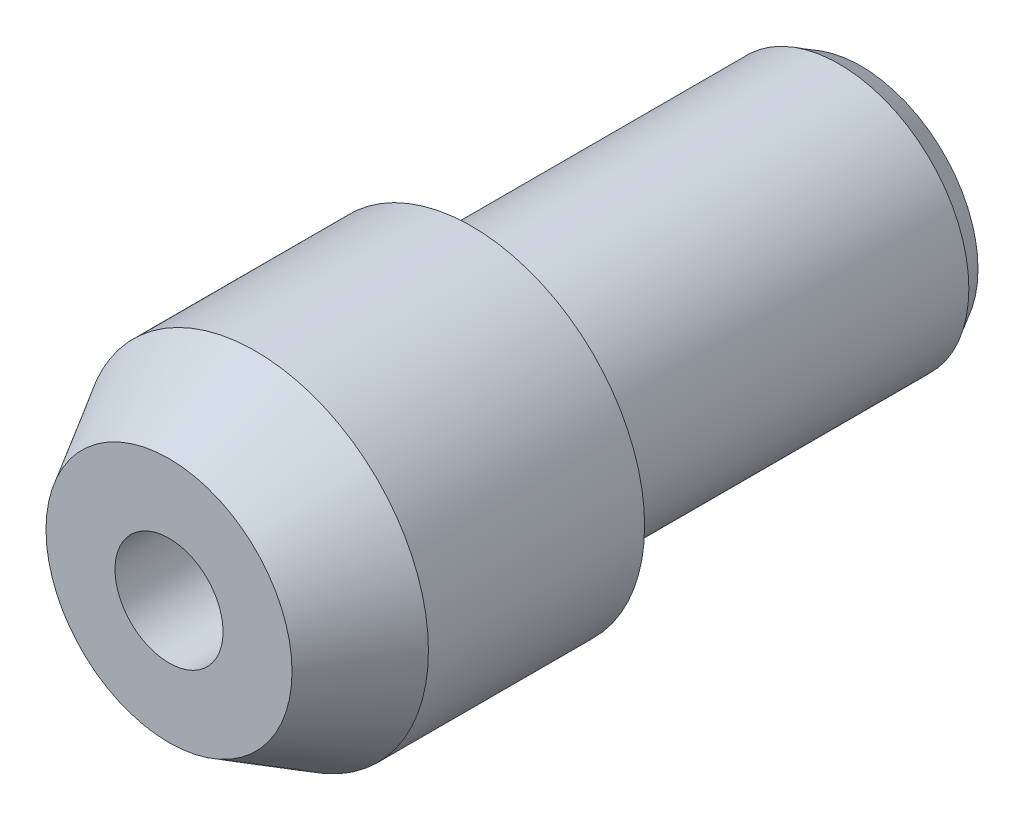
ISO-10303-21;
HEADER;
FILE_DESCRIPTION(('STEP AP214'),'2;1');
FILE_NAME('part.step','',(''),(''),'','','');
FILE_SCHEMA(('AUTOMOTIVE_DESIGN { 1 0 10303 214 1 1 1 1 }'));
ENDSEC;
DATA;
#1=APPLICATION_CONTEXT('core data for automotive mechanical design processes');
#2=APPLICATION_PROTOCOL_DEFINITION('international standard','automotive_design',2000,#1);
#3=PRODUCT_CONTEXT('',#1,'mechanical');
#4=PRODUCT('Part','Part','',(#3));
#5=PRODUCT_RELATED_PRODUCT_CATEGORY('part','',(#4));
#6=PRODUCT_DEFINITION_FORMATION('','',#4);
#7=PRODUCT_DEFINITION_CONTEXT('part definition',#1,'design');
#8=PRODUCT_DEFINITION('design','',#6,#7);
#9=PRODUCT_DEFINITION_SHAPE('','',#8);
#10=(LENGTH_UNIT() NAMED_UNIT(*) SI_UNIT(.MILLI.,.METRE.));
#11=(NAMED_UNIT(*) PLANE_ANGLE_UNIT() SI_UNIT($,.RADIAN.));
#12=(NAMED_UNIT(*) SI_UNIT($,.STERADIAN.) SOLID_ANGLE_UNIT());
#13=UNCERTAINTY_MEASURE_WITH_UNIT(LENGTH_MEASURE(1.E-05),#10,'distance_accuracy_value','');
#14=(GEOMETRIC_REPRESENTATION_CONTEXT(3) GLOBAL_UNCERTAINTY_ASSIGNED_CONTEXT((#13)) GLOBAL_UNIT_ASSIGNED_CONTEXT((#10,
#11,#12)) REPRESENTATION_CONTEXT('',''));
#15=CARTESIAN_POINT('',(0.,0.,0.));
#16=DIRECTION('',(0.,0.,1.));
#17=DIRECTION('',(1.,0.,0.));
#18=AXIS2_PLACEMENT_3D('',#15,#16,#17);
#19=CARTESIAN_POINT('',(0.,0.,-17.));
#20=DIRECTION('',(0.,0.,1.));
#21=DIRECTION('',(1.,0.,0.));
#22=AXIS2_PLACEMENT_3D('',#19,#20,#21);
#23=CONICAL_SURFACE('',#22,6.,0.523598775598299);
#24=CARTESIAN_POINT('',(0.,0.,-18.));
#25=DIRECTION('',(0.,0.,1.));
#26=DIRECTION('',(1.,0.,0.));
#27=AXIS2_PLACEMENT_3D('',#24,#25,#26);
#28=CIRCLE('',#27,5.42264973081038);
#29=CARTESIAN_POINT('',(5.42264973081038,0.,-18.));
#30=VERTEX_POINT('',#29);
#31=EDGE_CURVE('E40',#30,#30,#28,.T.);
#32=ORIENTED_EDGE('',*,*,#31,.T.);
#33=EDGE_LOOP('',(#32));
#34=FACE_BOUND('',#33,.T.);
#35=CARTESIAN_POINT('',(0.,0.,-17.));
#36=DIRECTION('',(0.,0.,1.));
#37=DIRECTION('',(1.,0.,0.));
#38=AXIS2_PLACEMENT_3D('',#35,#36,#37);
#39=CIRCLE('',#38,6.);
#40=CARTESIAN_POINT('',(6.,0.,-17.));
#41=VERTEX_POINT('',#40);
#42=EDGE_CURVE('E8',#41,#41,#39,.T.);
#43=ORIENTED_EDGE('',*,*,#42,.F.);
#44=EDGE_LOOP('',(#43));
#45=FACE_BOUND('',#44,.T.);
#46=ADVANCED_FACE('F12',(#34,#45),#23,.T.);
#47=CARTESIAN_POINT('',(0.,0.,20.));
#48=DIRECTION('',(0.,0.,1.));
#49=DIRECTION('',(1.,0.,0.));
#50=AXIS2_PLACEMENT_3D('',#47,#48,#49);
#51=CYLINDRICAL_SURFACE('',#50,6.);
#52=ORIENTED_EDGE('',*,*,#42,.T.);
#53=EDGE_LOOP('',(#52));
#54=FACE_BOUND('',#53,.T.);
#55=CARTESIAN_POINT('',(0.,0.,0.));
#56=DIRECTION('',(0.,0.,1.));
#57=DIRECTION('',(1.,0.,0.));
#58=AXIS2_PLACEMENT_3D('',#55,#56,#57);
#59=CIRCLE('',#58,6.);
#60=CARTESIAN_POINT('',(6.,0.,0.));
#61=VERTEX_POINT('',#60);
#62=EDGE_CURVE('E18',#61,#61,#59,.T.);
#63=ORIENTED_EDGE('',*,*,#62,.F.);
#64=EDGE_LOOP('',(#63));
#65=FACE_BOUND('',#64,.T.);
#66=ADVANCED_FACE('F72',(#54,#65),#51,.T.);
#67=CARTESIAN_POINT('',(6.,0.,0.));
#68=DIRECTION('',(0.,0.,1.));
#69=DIRECTION('',(1.,0.,0.));
#70=AXIS2_PLACEMENT_3D('',#67,#68,#69);
#71=PLANE('',#70);
#72=CARTESIAN_POINT('',(0.,0.,0.));
#73=DIRECTION('',(0.,0.,1.));
#74=DIRECTION('',(1.,0.,0.));
#75=AXIS2_PLACEMENT_3D('',#72,#73,#74);
#76=CIRCLE('',#75,8.);
#77=CARTESIAN_POINT('',(8.,0.,0.));
#78=VERTEX_POINT('',#77);
#79=EDGE_CURVE('E22',#78,#78,#76,.T.);
#80=ORIENTED_EDGE('',*,*,#79,.F.);
#81=EDGE_LOOP('',(#80));
#82=FACE_BOUND('',#81,.T.);
#83=ORIENTED_EDGE('',*,*,#62,.T.);
#84=EDGE_LOOP('',(#83));
#85=FACE_BOUND('',#84,.T.);
#86=ADVANCED_FACE('F77',(#82,#85),#71,.F.);
#87=CARTESIAN_POINT('',(0.,0.,20.));
#88=DIRECTION('',(0.,0.,1.));
#89=DIRECTION('',(1.,0.,0.));
#90=AXIS2_PLACEMENT_3D('',#87,#88,#89);
#91=CYLINDRICAL_SURFACE('',#90,8.);
#92=ORIENTED_EDGE('',*,*,#79,.T.);
#93=EDGE_LOOP('',(#92));
#94=FACE_BOUND('',#93,.T.);
#95=CARTESIAN_POINT('',(0.,0.,10.));
#96=DIRECTION('',(0.,0.,1.));
#97=DIRECTION('',(1.,0.,0.));
#98=AXIS2_PLACEMENT_3D('',#95,#96,#97);
#99=CIRCLE('',#98,8.);
#100=CARTESIAN_POINT('',(8.,0.,10.));
#101=VERTEX_POINT('',#100);
#102=EDGE_CURVE('E26',#101,#101,#99,.T.);
#103=ORIENTED_EDGE('',*,*,#102,.F.);
#104=EDGE_LOOP('',(#103));
#105=FACE_BOUND('',#104,.T.);
#106=ADVANCED_FACE('F82',(#94,#105),#91,.T.);
#107=CARTESIAN_POINT('',(0.,0.,10.));
#108=DIRECTION('',(0.,0.,-1.));
#109=DIRECTION('',(-1.,0.,0.));
#110=AXIS2_PLACEMENT_3D('',#107,#108,#109);
#111=CONICAL_SURFACE('',#110,8.,0.523598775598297);
#112=CARTESIAN_POINT('',(0.,0.,14.));
#113=DIRECTION('',(0.,0.,1.));
#114=DIRECTION('',(1.,0.,0.));
#115=AXIS2_PLACEMENT_3D('',#112,#113,#114);
#116=CIRCLE('',#115,5.69059892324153);
#117=CARTESIAN_POINT('',(5.69059892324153,0.,14.));
#118=VERTEX_POINT('',#117);
#119=EDGE_CURVE('E31',#118,#118,#116,.T.);
#120=ORIENTED_EDGE('',*,*,#119,.F.);
#121=EDGE_LOOP('',(#120));
#122=FACE_BOUND('',#121,.T.);
#123=ORIENTED_EDGE('',*,*,#102,.T.);
#124=EDGE_LOOP('',(#123));
#125=FACE_BOUND('',#124,.T.);
#126=ADVANCED_FACE('F89',(#122,#125),#111,.T.);
#127=CARTESIAN_POINT('',(2.5,0.,14.));
#128=DIRECTION('',(0.,0.,1.));
#129=DIRECTION('',(1.,0.,0.));
#130=AXIS2_PLACEMENT_3D('',#127,#128,#129);
#131=PLANE('',#130);
#132=ORIENTED_EDGE('',*,*,#119,.T.);
#133=EDGE_LOOP('',(#132));
#134=FACE_BOUND('',#133,.T.);
#135=CARTESIAN_POINT('',(0.,0.,14.));
#136=DIRECTION('',(0.,0.,1.));
#137=DIRECTION('',(1.,0.,0.));
#138=AXIS2_PLACEMENT_3D('',#135,#136,#137);
#139=CIRCLE('',#138,2.5);
#140=CARTESIAN_POINT('',(2.5,0.,14.));
#141=VERTEX_POINT('',#140);
#142=EDGE_CURVE('E34',#141,#141,#139,.T.);
#143=ORIENTED_EDGE('',*,*,#142,.F.);
#144=EDGE_LOOP('',(#143));
#145=FACE_BOUND('',#144,.T.);
#146=ADVANCED_FACE('F93',(#134,#145),#131,.T.);
#147=CARTESIAN_POINT('',(0.,0.,20.));
#148=DIRECTION('',(0.,0.,1.));
#149=DIRECTION('',(1.,0.,0.));
#150=AXIS2_PLACEMENT_3D('',#147,#148,#149);
#151=CYLINDRICAL_SURFACE('',#150,2.5);
#152=CARTESIAN_POINT('',(0.,0.,6.));
#153=DIRECTION('',(0.,0.,1.));
#154=DIRECTION('',(1.,0.,0.));
#155=AXIS2_PLACEMENT_3D('',#152,#153,#154);
#156=CIRCLE('',#155,2.5);
#157=CARTESIAN_POINT('',(2.5,0.,6.));
#158=VERTEX_POINT('',#157);
#159=EDGE_CURVE('E43',#158,#158,#156,.T.);
#160=ORIENTED_EDGE('',*,*,#159,.F.);
#161=EDGE_LOOP('',(#160));
#162=FACE_BOUND('',#161,.T.);
#163=ORIENTED_EDGE('',*,*,#142,.T.);
#164=EDGE_LOOP('',(#163));
#165=FACE_BOUND('',#164,.T.);
#166=ADVANCED_FACE('F56',(#162,#165),#151,.F.);
#167=CARTESIAN_POINT('',(0.,0.,20.));
#168=DIRECTION('',(0.,0.,1.));
#169=DIRECTION('',(1.,0.,0.));
#170=AXIS2_PLACEMENT_3D('',#167,#168,#169);
#171=CYLINDRICAL_SURFACE('',#170,1.);
#172=CARTESIAN_POINT('',(0.,0.,-14.));
#173=DIRECTION('',(0.,0.,-1.));
#174=DIRECTION('',(-1.,0.,0.));
#175=AXIS2_PLACEMENT_3D('',#172,#173,#174);
#176=CIRCLE('',#175,1.);
#177=CARTESIAN_POINT('',(-1.,0.,-14.));
#178=VERTEX_POINT('',#177);
#179=EDGE_CURVE('E46',#178,#178,#176,.T.);
#180=ORIENTED_EDGE('',*,*,#179,.F.);
#181=EDGE_LOOP('',(#180));
#182=FACE_BOUND('',#181,.T.);
#183=CARTESIAN_POINT('',(0.,0.,-18.));
#184=DIRECTION('',(0.,0.,1.));
#185=DIRECTION('',(1.,0.,0.));
#186=AXIS2_PLACEMENT_3D('',#183,#184,#185);
#187=CIRCLE('',#186,1.);
#188=CARTESIAN_POINT('',(1.,0.,-18.));
#189=VERTEX_POINT('',#188);
#190=EDGE_CURVE('E37',#189,#189,#187,.T.);
#191=ORIENTED_EDGE('',*,*,#190,.F.);
#192=EDGE_LOOP('',(#191));
#193=FACE_BOUND('',#192,.T.);
#194=ADVANCED_FACE('F52',(#182,#193),#171,.F.);
#195=CARTESIAN_POINT('',(1.,0.,-18.));
#196=DIRECTION('',(0.,0.,1.));
#197=DIRECTION('',(1.,0.,0.));
#198=AXIS2_PLACEMENT_3D('',#195,#196,#197);
#199=PLANE('',#198);
#200=ORIENTED_EDGE('',*,*,#31,.F.);
#201=EDGE_LOOP('',(#200));
#202=FACE_BOUND('',#201,.T.);
#203=ORIENTED_EDGE('',*,*,#190,.T.);
#204=EDGE_LOOP('',(#203));
#205=FACE_BOUND('',#204,.T.);
#206=ADVANCED_FACE('F55',(#202,#205),#199,.F.);
#207=CARTESIAN_POINT('',(0.,0.,6.));
#208=DIRECTION('',(0.,0.,1.));
#209=DIRECTION('',(1.,0.,0.));
#210=AXIS2_PLACEMENT_3D('',#207,#208,#209);
#211=PLANE('',#210);
#212=ORIENTED_EDGE('',*,*,#159,.T.);
#213=EDGE_LOOP('',(#212));
#214=FACE_BOUND('',#213,.T.);
#215=ADVANCED_FACE('F61',(#214),#211,.T.);
#216=CARTESIAN_POINT('',(0.,0.,-14.));
#217=DIRECTION('',(0.,0.,-1.));
#218=DIRECTION('',(-1.,0.,0.));
#219=AXIS2_PLACEMENT_3D('',#216,#217,#218);
#220=PLANE('',#219);
#221=ORIENTED_EDGE('',*,*,#179,.T.);
#222=EDGE_LOOP('',(#221));
#223=FACE_BOUND('',#222,.T.);
#224=ADVANCED_FACE('F50',(#223),#220,.T.);
#225=CLOSED_SHELL('',(#46,#66,#86,#106,#126,#146,#166,#194,#206,#215,#224));
#226=MANIFOLD_SOLID_BREP('B1',#225);
#227=ADVANCED_BREP_SHAPE_REPRESENTATION('',(#18,#226),#14);
#228=SHAPE_DEFINITION_REPRESENTATION(#9,#227);
ENDSEC;
END-ISO-10303-21;
